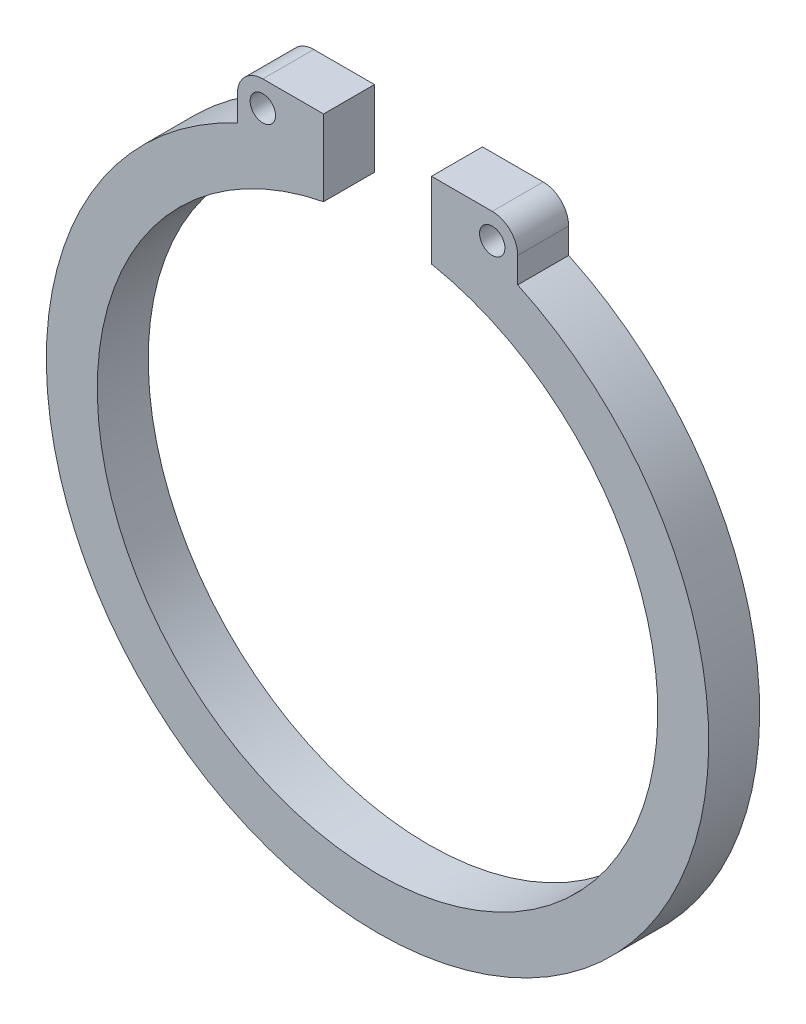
from build123d import *

# Parameters (mm, degrees)
ESQUISSE1_R          = 0.249
BASE_EXTRUSION_DEPTH = 1


with BuildPart() as part:
    # Esquisse1 → Base-Extrusion (new body)
    with BuildSketch(Plane.XY):
        with BuildLine():
            Line((2.251228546, 6.889035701), (1.059147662, 6.889035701))
            Line((1.059147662, 6.889035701), (1.059147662, 5.39705533))
            ThreePointArc((1.059147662, 5.39705533), (0, -5.5), (-1.059147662, 5.39705533))
            Line((-1.059147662, 5.39705533), (-1.059147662, 6.889035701))
            Line((-1.059147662, 6.889035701), (-2.251228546, 6.889035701))
            ThreePointArc((-2.251228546, 6.889035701), (-2.604781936, 6.742589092), (-2.751228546, 6.389035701))
            Line((-2.751228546, 6.389035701), (-2.751228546, 5.889035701))
            ThreePointArc((-2.751228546, 5.889035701), (0, -6.5), (2.751228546, 5.889035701))
            Line((2.751228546, 5.889035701), (2.751228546, 6.389035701))
            ThreePointArc((2.751228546, 6.389035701), (2.604781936, 6.742589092), (2.251228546, 6.889035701))
        make_face()
        with Locations((2.251228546, 6.389035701)):
            Circle(ESQUISSE1_R, mode=Mode.SUBTRACT)
        with Locations(Location((-2.251228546, 6.389035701, 0), (0, 0, 180))):
            Circle(ESQUISSE1_R, mode=Mode.SUBTRACT)
    extrude(amount=BASE_EXTRUSION_DEPTH)


solid = part.part
